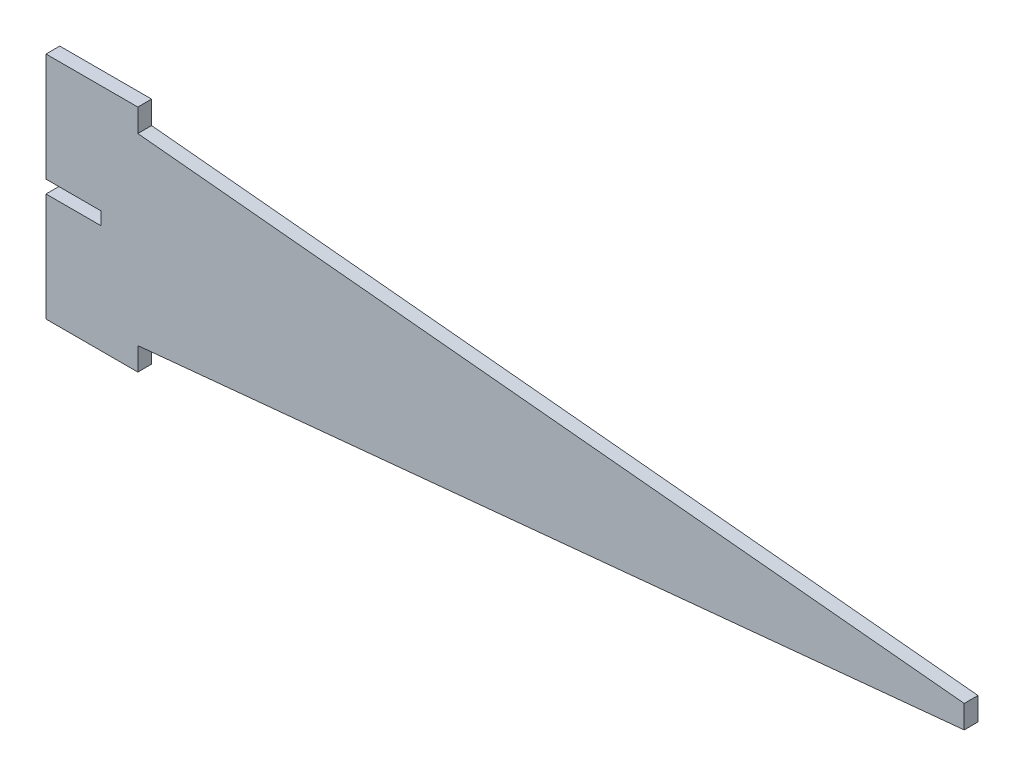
ISO-10303-21;
HEADER;
FILE_DESCRIPTION(('STEP AP214'),'2;1');
FILE_NAME('part.step','',(''),(''),'','','');
FILE_SCHEMA(('AUTOMOTIVE_DESIGN { 1 0 10303 214 1 1 1 1 }'));
ENDSEC;
DATA;
#1=APPLICATION_CONTEXT('core data for automotive mechanical design processes');
#2=APPLICATION_PROTOCOL_DEFINITION('international standard','automotive_design',2000,#1);
#3=PRODUCT_CONTEXT('',#1,'mechanical');
#4=PRODUCT('Part','Part','',(#3));
#5=PRODUCT_RELATED_PRODUCT_CATEGORY('part','',(#4));
#6=PRODUCT_DEFINITION_FORMATION('','',#4);
#7=PRODUCT_DEFINITION_CONTEXT('part definition',#1,'design');
#8=PRODUCT_DEFINITION('design','',#6,#7);
#9=PRODUCT_DEFINITION_SHAPE('','',#8);
#10=(LENGTH_UNIT() NAMED_UNIT(*) SI_UNIT(.MILLI.,.METRE.));
#11=(NAMED_UNIT(*) PLANE_ANGLE_UNIT() SI_UNIT($,.RADIAN.));
#12=(NAMED_UNIT(*) SI_UNIT($,.STERADIAN.) SOLID_ANGLE_UNIT());
#13=UNCERTAINTY_MEASURE_WITH_UNIT(LENGTH_MEASURE(1.E-05),#10,'distance_accuracy_value','');
#14=(GEOMETRIC_REPRESENTATION_CONTEXT(3) GLOBAL_UNCERTAINTY_ASSIGNED_CONTEXT((#13)) GLOBAL_UNIT_ASSIGNED_CONTEXT((#10,
#11,#12)) REPRESENTATION_CONTEXT('',''));
#15=CARTESIAN_POINT('',(0.,0.,0.));
#16=DIRECTION('',(0.,0.,1.));
#17=DIRECTION('',(1.,0.,0.));
#18=AXIS2_PLACEMENT_3D('',#15,#16,#17);
#19=CARTESIAN_POINT('',(-12.,1.4,3.));
#20=DIRECTION('',(1.,0.,0.));
#21=DIRECTION('',(0.,0.,-1.));
#22=AXIS2_PLACEMENT_3D('',#19,#20,#21);
#23=PLANE('',#22);
#24=DIRECTION('',(0.,-1.,0.));
#25=VECTOR('',#24,1.);
#26=CARTESIAN_POINT('',(-12.,1.4,0.));
#27=LINE('',#26,#25);
#28=CARTESIAN_POINT('',(-12.,25.,0.));
#29=VERTEX_POINT('',#28);
#30=CARTESIAN_POINT('',(-12.,1.4,0.));
#31=VERTEX_POINT('',#30);
#32=EDGE_CURVE('E157',#29,#31,#27,.T.);
#33=ORIENTED_EDGE('',*,*,#32,.T.);
#34=DIRECTION('',(0.,0.,-1.));
#35=VECTOR('',#34,1.);
#36=CARTESIAN_POINT('',(-12.,1.4,3.));
#37=LINE('',#36,#35);
#38=CARTESIAN_POINT('',(-12.,1.4,3.));
#39=VERTEX_POINT('',#38);
#40=EDGE_CURVE('E11',#39,#31,#37,.T.);
#41=ORIENTED_EDGE('',*,*,#40,.F.);
#42=DIRECTION('',(0.,-1.,0.));
#43=VECTOR('',#42,1.);
#44=CARTESIAN_POINT('',(-12.,1.4,3.));
#45=LINE('',#44,#43);
#46=CARTESIAN_POINT('',(-12.,25.,3.));
#47=VERTEX_POINT('',#46);
#48=EDGE_CURVE('E182',#47,#39,#45,.T.);
#49=ORIENTED_EDGE('',*,*,#48,.F.);
#50=DIRECTION('',(0.,0.,-1.));
#51=VECTOR('',#50,1.);
#52=CARTESIAN_POINT('',(-12.,25.,3.));
#53=LINE('',#52,#51);
#54=EDGE_CURVE('E154',#47,#29,#53,.T.);
#55=ORIENTED_EDGE('',*,*,#54,.T.);
#56=EDGE_LOOP('',(#33,#41,#49,#55));
#57=FACE_BOUND('',#56,.T.);
#58=ADVANCED_FACE('F39',(#57),#23,.F.);
#59=CARTESIAN_POINT('',(-12.,1.4,3.));
#60=DIRECTION('',(0.,1.,0.));
#61=DIRECTION('',(0.,0.,1.));
#62=AXIS2_PLACEMENT_3D('',#59,#60,#61);
#63=PLANE('',#62);
#64=DIRECTION('',(1.,0.,0.));
#65=VECTOR('',#64,1.);
#66=CARTESIAN_POINT('',(-12.,1.4,0.));
#67=LINE('',#66,#65);
#68=CARTESIAN_POINT('',(0.,1.4,0.));
#69=VERTEX_POINT('',#68);
#70=EDGE_CURVE('E165',#31,#69,#67,.T.);
#71=ORIENTED_EDGE('',*,*,#70,.T.);
#72=DIRECTION('',(0.,0.,-1.));
#73=VECTOR('',#72,1.);
#74=CARTESIAN_POINT('',(0.,1.4,3.));
#75=LINE('',#74,#73);
#76=CARTESIAN_POINT('',(0.,1.4,3.));
#77=VERTEX_POINT('',#76);
#78=EDGE_CURVE('E50',#77,#69,#75,.T.);
#79=ORIENTED_EDGE('',*,*,#78,.F.);
#80=DIRECTION('',(1.,0.,0.));
#81=VECTOR('',#80,1.);
#82=CARTESIAN_POINT('',(-12.,1.4,3.));
#83=LINE('',#82,#81);
#84=EDGE_CURVE('E109',#39,#77,#83,.T.);
#85=ORIENTED_EDGE('',*,*,#84,.F.);
#86=ORIENTED_EDGE('',*,*,#40,.T.);
#87=EDGE_LOOP('',(#71,#79,#85,#86));
#88=FACE_BOUND('',#87,.T.);
#89=ADVANCED_FACE('F259',(#88),#63,.F.);
#90=CARTESIAN_POINT('',(0.,-1.4,3.));
#91=DIRECTION('',(1.,0.,0.));
#92=DIRECTION('',(0.,0.,-1.));
#93=AXIS2_PLACEMENT_3D('',#90,#91,#92);
#94=PLANE('',#93);
#95=DIRECTION('',(0.,-1.,0.));
#96=VECTOR('',#95,1.);
#97=CARTESIAN_POINT('',(0.,-1.4,0.));
#98=LINE('',#97,#96);
#99=CARTESIAN_POINT('',(0.,-1.4,0.));
#100=VERTEX_POINT('',#99);
#101=EDGE_CURVE('E163',#69,#100,#98,.T.);
#102=ORIENTED_EDGE('',*,*,#101,.T.);
#103=DIRECTION('',(0.,0.,-1.));
#104=VECTOR('',#103,1.);
#105=CARTESIAN_POINT('',(0.,-1.4,3.));
#106=LINE('',#105,#104);
#107=CARTESIAN_POINT('',(0.,-1.4,3.));
#108=VERTEX_POINT('',#107);
#109=EDGE_CURVE('E199',#108,#100,#106,.T.);
#110=ORIENTED_EDGE('',*,*,#109,.F.);
#111=DIRECTION('',(0.,-1.,0.));
#112=VECTOR('',#111,1.);
#113=CARTESIAN_POINT('',(0.,-1.4,3.));
#114=LINE('',#113,#112);
#115=EDGE_CURVE('E208',#77,#108,#114,.T.);
#116=ORIENTED_EDGE('',*,*,#115,.F.);
#117=ORIENTED_EDGE('',*,*,#78,.T.);
#118=EDGE_LOOP('',(#102,#110,#116,#117));
#119=FACE_BOUND('',#118,.T.);
#120=ADVANCED_FACE('F206',(#119),#94,.F.);
#121=CARTESIAN_POINT('',(-12.,-1.4,3.));
#122=DIRECTION('',(0.,-1.,0.));
#123=DIRECTION('',(0.,0.,-1.));
#124=AXIS2_PLACEMENT_3D('',#121,#122,#123);
#125=PLANE('',#124);
#126=DIRECTION('',(-1.,0.,0.));
#127=VECTOR('',#126,1.);
#128=CARTESIAN_POINT('',(-12.,-1.4,0.));
#129=LINE('',#128,#127);
#130=CARTESIAN_POINT('',(-12.,-1.4,0.));
#131=VERTEX_POINT('',#130);
#132=EDGE_CURVE('E167',#100,#131,#129,.T.);
#133=ORIENTED_EDGE('',*,*,#132,.T.);
#134=DIRECTION('',(0.,0.,-1.));
#135=VECTOR('',#134,1.);
#136=CARTESIAN_POINT('',(-12.,-1.4,3.));
#137=LINE('',#136,#135);
#138=CARTESIAN_POINT('',(-12.,-1.4,3.));
#139=VERTEX_POINT('',#138);
#140=EDGE_CURVE('E197',#139,#131,#137,.T.);
#141=ORIENTED_EDGE('',*,*,#140,.F.);
#142=DIRECTION('',(-1.,0.,0.));
#143=VECTOR('',#142,1.);
#144=CARTESIAN_POINT('',(-12.,-1.4,3.));
#145=LINE('',#144,#143);
#146=EDGE_CURVE('E227',#108,#139,#145,.T.);
#147=ORIENTED_EDGE('',*,*,#146,.F.);
#148=ORIENTED_EDGE('',*,*,#109,.T.);
#149=EDGE_LOOP('',(#133,#141,#147,#148));
#150=FACE_BOUND('',#149,.T.);
#151=ADVANCED_FACE('F220',(#150),#125,.F.);
#152=CARTESIAN_POINT('',(-12.,-25.,3.));
#153=DIRECTION('',(1.,0.,0.));
#154=DIRECTION('',(0.,0.,-1.));
#155=AXIS2_PLACEMENT_3D('',#152,#153,#154);
#156=PLANE('',#155);
#157=DIRECTION('',(0.,-1.,0.));
#158=VECTOR('',#157,1.);
#159=CARTESIAN_POINT('',(-12.,-25.,0.));
#160=LINE('',#159,#158);
#161=CARTESIAN_POINT('',(-12.,-25.,0.));
#162=VERTEX_POINT('',#161);
#163=EDGE_CURVE('E169',#131,#162,#160,.T.);
#164=ORIENTED_EDGE('',*,*,#163,.T.);
#165=DIRECTION('',(0.,0.,-1.));
#166=VECTOR('',#165,1.);
#167=CARTESIAN_POINT('',(-12.,-25.,3.));
#168=LINE('',#167,#166);
#169=CARTESIAN_POINT('',(-12.,-25.,3.));
#170=VERTEX_POINT('',#169);
#171=EDGE_CURVE('E195',#170,#162,#168,.T.);
#172=ORIENTED_EDGE('',*,*,#171,.F.);
#173=DIRECTION('',(0.,-1.,0.));
#174=VECTOR('',#173,1.);
#175=CARTESIAN_POINT('',(-12.,-25.,3.));
#176=LINE('',#175,#174);
#177=EDGE_CURVE('E224',#139,#170,#176,.T.);
#178=ORIENTED_EDGE('',*,*,#177,.F.);
#179=ORIENTED_EDGE('',*,*,#140,.T.);
#180=EDGE_LOOP('',(#164,#172,#178,#179));
#181=FACE_BOUND('',#180,.T.);
#182=ADVANCED_FACE('F222',(#181),#156,.F.);
#183=CARTESIAN_POINT('',(-12.,-25.,3.));
#184=DIRECTION('',(0.,1.,0.));
#185=DIRECTION('',(0.,0.,1.));
#186=AXIS2_PLACEMENT_3D('',#183,#184,#185);
#187=PLANE('',#186);
#188=DIRECTION('',(1.,0.,0.));
#189=VECTOR('',#188,1.);
#190=CARTESIAN_POINT('',(-12.,-25.,0.));
#191=LINE('',#190,#189);
#192=CARTESIAN_POINT('',(8.,-25.,0.));
#193=VERTEX_POINT('',#192);
#194=EDGE_CURVE('E168',#162,#193,#191,.T.);
#195=ORIENTED_EDGE('',*,*,#194,.T.);
#196=DIRECTION('',(0.,0.,-1.));
#197=VECTOR('',#196,1.);
#198=CARTESIAN_POINT('',(8.,-25.,3.));
#199=LINE('',#198,#197);
#200=CARTESIAN_POINT('',(8.,-25.,3.));
#201=VERTEX_POINT('',#200);
#202=EDGE_CURVE('E193',#201,#193,#199,.T.);
#203=ORIENTED_EDGE('',*,*,#202,.F.);
#204=DIRECTION('',(1.,0.,0.));
#205=VECTOR('',#204,1.);
#206=CARTESIAN_POINT('',(-12.,-25.,3.));
#207=LINE('',#206,#205);
#208=EDGE_CURVE('E223',#170,#201,#207,.T.);
#209=ORIENTED_EDGE('',*,*,#208,.F.);
#210=ORIENTED_EDGE('',*,*,#171,.T.);
#211=EDGE_LOOP('',(#195,#203,#209,#210));
#212=FACE_BOUND('',#211,.T.);
#213=ADVANCED_FACE('F275',(#212),#187,.F.);
#214=CARTESIAN_POINT('',(8.,-25.,3.));
#215=DIRECTION('',(-1.,0.,0.));
#216=DIRECTION('',(0.,-1.,0.));
#217=AXIS2_PLACEMENT_3D('',#214,#215,#216);
#218=PLANE('',#217);
#219=DIRECTION('',(0.,1.,0.));
#220=VECTOR('',#219,1.);
#221=CARTESIAN_POINT('',(8.,-25.,0.));
#222=LINE('',#221,#220);
#223=CARTESIAN_POINT('',(7.99999999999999,-20.,0.));
#224=VERTEX_POINT('',#223);
#225=EDGE_CURVE('E175',#193,#224,#222,.T.);
#226=ORIENTED_EDGE('',*,*,#225,.T.);
#227=DIRECTION('',(0.,0.,-1.));
#228=VECTOR('',#227,1.);
#229=CARTESIAN_POINT('',(7.99999999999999,-20.,3.));
#230=LINE('',#229,#228);
#231=CARTESIAN_POINT('',(7.99999999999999,-20.,3.));
#232=VERTEX_POINT('',#231);
#233=EDGE_CURVE('E189',#232,#224,#230,.T.);
#234=ORIENTED_EDGE('',*,*,#233,.F.);
#235=DIRECTION('',(0.,1.,0.));
#236=VECTOR('',#235,1.);
#237=CARTESIAN_POINT('',(8.,-25.,3.));
#238=LINE('',#237,#236);
#239=EDGE_CURVE('E229',#201,#232,#238,.T.);
#240=ORIENTED_EDGE('',*,*,#239,.F.);
#241=ORIENTED_EDGE('',*,*,#202,.T.);
#242=EDGE_LOOP('',(#226,#234,#240,#241));
#243=FACE_BOUND('',#242,.T.);
#244=ADVANCED_FACE('F274',(#243),#218,.F.);
#245=CARTESIAN_POINT('',(7.99999999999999,-20.,3.));
#246=DIRECTION('',(-0.0967659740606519,0.995307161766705,0.));
#247=DIRECTION('',(-0.995307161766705,-0.0967659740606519,0.));
#248=AXIS2_PLACEMENT_3D('',#245,#246,#247);
#249=PLANE('',#248);
#250=DIRECTION('',(0.995307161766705,0.0967659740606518,0.));
#251=VECTOR('',#250,1.);
#252=CARTESIAN_POINT('',(7.99999999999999,-20.,0.));
#253=LINE('',#252,#251);
#254=CARTESIAN_POINT('',(188.,-2.5,0.));
#255=VERTEX_POINT('',#254);
#256=EDGE_CURVE('E171',#224,#255,#253,.T.);
#257=ORIENTED_EDGE('',*,*,#256,.T.);
#258=DIRECTION('',(0.,0.,-1.));
#259=VECTOR('',#258,1.);
#260=CARTESIAN_POINT('',(188.,-2.5,3.));
#261=LINE('',#260,#259);
#262=CARTESIAN_POINT('',(188.,-2.5,3.));
#263=VERTEX_POINT('',#262);
#264=EDGE_CURVE('E183',#263,#255,#261,.T.);
#265=ORIENTED_EDGE('',*,*,#264,.F.);
#266=DIRECTION('',(0.995307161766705,0.0967659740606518,0.));
#267=VECTOR('',#266,1.);
#268=CARTESIAN_POINT('',(7.99999999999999,-20.,3.));
#269=LINE('',#268,#267);
#270=EDGE_CURVE('E235',#232,#263,#269,.T.);
#271=ORIENTED_EDGE('',*,*,#270,.F.);
#272=ORIENTED_EDGE('',*,*,#233,.T.);
#273=EDGE_LOOP('',(#257,#265,#271,#272));
#274=FACE_BOUND('',#273,.T.);
#275=ADVANCED_FACE('F238',(#274),#249,.F.);
#276=CARTESIAN_POINT('',(188.,2.5,3.));
#277=DIRECTION('',(-1.,0.,0.));
#278=DIRECTION('',(0.,0.,1.));
#279=AXIS2_PLACEMENT_3D('',#276,#277,#278);
#280=PLANE('',#279);
#281=DIRECTION('',(0.,1.,0.));
#282=VECTOR('',#281,1.);
#283=CARTESIAN_POINT('',(188.,2.5,0.));
#284=LINE('',#283,#282);
#285=CARTESIAN_POINT('',(188.,2.5,0.));
#286=VERTEX_POINT('',#285);
#287=EDGE_CURVE('E178',#255,#286,#284,.T.);
#288=ORIENTED_EDGE('',*,*,#287,.T.);
#289=DIRECTION('',(0.,0.,-1.));
#290=VECTOR('',#289,1.);
#291=CARTESIAN_POINT('',(188.,2.5,3.));
#292=LINE('',#291,#290);
#293=CARTESIAN_POINT('',(188.,2.5,3.));
#294=VERTEX_POINT('',#293);
#295=EDGE_CURVE('E147',#294,#286,#292,.T.);
#296=ORIENTED_EDGE('',*,*,#295,.F.);
#297=DIRECTION('',(0.,1.,0.));
#298=VECTOR('',#297,1.);
#299=CARTESIAN_POINT('',(188.,2.5,3.));
#300=LINE('',#299,#298);
#301=EDGE_CURVE('E143',#263,#294,#300,.T.);
#302=ORIENTED_EDGE('',*,*,#301,.F.);
#303=ORIENTED_EDGE('',*,*,#264,.T.);
#304=EDGE_LOOP('',(#288,#296,#302,#303));
#305=FACE_BOUND('',#304,.T.);
#306=ADVANCED_FACE('F241',(#305),#280,.F.);
#307=CARTESIAN_POINT('',(7.99999999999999,20.,3.));
#308=DIRECTION('',(-0.0967659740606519,-0.995307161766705,0.));
#309=DIRECTION('',(0.995307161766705,-0.0967659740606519,0.));
#310=AXIS2_PLACEMENT_3D('',#307,#308,#309);
#311=PLANE('',#310);
#312=DIRECTION('',(-0.995307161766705,0.0967659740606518,0.));
#313=VECTOR('',#312,1.);
#314=CARTESIAN_POINT('',(7.99999999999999,20.,0.));
#315=LINE('',#314,#313);
#316=CARTESIAN_POINT('',(7.99999999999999,20.,0.));
#317=VERTEX_POINT('',#316);
#318=EDGE_CURVE('E149',#286,#317,#315,.T.);
#319=ORIENTED_EDGE('',*,*,#318,.T.);
#320=DIRECTION('',(0.,0.,-1.));
#321=VECTOR('',#320,1.);
#322=CARTESIAN_POINT('',(7.99999999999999,20.,3.));
#323=LINE('',#322,#321);
#324=CARTESIAN_POINT('',(7.99999999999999,20.,3.));
#325=VERTEX_POINT('',#324);
#326=EDGE_CURVE('E148',#325,#317,#323,.T.);
#327=ORIENTED_EDGE('',*,*,#326,.F.);
#328=DIRECTION('',(-0.995307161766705,0.0967659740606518,0.));
#329=VECTOR('',#328,1.);
#330=CARTESIAN_POINT('',(7.99999999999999,20.,3.));
#331=LINE('',#330,#329);
#332=EDGE_CURVE('E133',#294,#325,#331,.T.);
#333=ORIENTED_EDGE('',*,*,#332,.F.);
#334=ORIENTED_EDGE('',*,*,#295,.T.);
#335=EDGE_LOOP('',(#319,#327,#333,#334));
#336=FACE_BOUND('',#335,.T.);
#337=ADVANCED_FACE('F150',(#336),#311,.F.);
#338=CARTESIAN_POINT('',(8.,25.,3.));
#339=DIRECTION('',(-1.,0.,0.));
#340=DIRECTION('',(0.,-1.,0.));
#341=AXIS2_PLACEMENT_3D('',#338,#339,#340);
#342=PLANE('',#341);
#343=DIRECTION('',(0.,1.,0.));
#344=VECTOR('',#343,1.);
#345=CARTESIAN_POINT('',(8.,25.,0.));
#346=LINE('',#345,#344);
#347=CARTESIAN_POINT('',(8.,25.,0.));
#348=VERTEX_POINT('',#347);
#349=EDGE_CURVE('E96',#317,#348,#346,.T.);
#350=ORIENTED_EDGE('',*,*,#349,.T.);
#351=DIRECTION('',(0.,0.,-1.));
#352=VECTOR('',#351,1.);
#353=CARTESIAN_POINT('',(8.,25.,3.));
#354=LINE('',#353,#352);
#355=CARTESIAN_POINT('',(8.,25.,3.));
#356=VERTEX_POINT('',#355);
#357=EDGE_CURVE('E151',#356,#348,#354,.T.);
#358=ORIENTED_EDGE('',*,*,#357,.F.);
#359=DIRECTION('',(0.,1.,0.));
#360=VECTOR('',#359,1.);
#361=CARTESIAN_POINT('',(8.,25.,3.));
#362=LINE('',#361,#360);
#363=EDGE_CURVE('E140',#325,#356,#362,.T.);
#364=ORIENTED_EDGE('',*,*,#363,.F.);
#365=ORIENTED_EDGE('',*,*,#326,.T.);
#366=EDGE_LOOP('',(#350,#358,#364,#365));
#367=FACE_BOUND('',#366,.T.);
#368=ADVANCED_FACE('F153',(#367),#342,.F.);
#369=CARTESIAN_POINT('',(-12.,25.,3.));
#370=DIRECTION('',(0.,-1.,0.));
#371=DIRECTION('',(0.,0.,-1.));
#372=AXIS2_PLACEMENT_3D('',#369,#370,#371);
#373=PLANE('',#372);
#374=DIRECTION('',(-1.,0.,0.));
#375=VECTOR('',#374,1.);
#376=CARTESIAN_POINT('',(-12.,25.,0.));
#377=LINE('',#376,#375);
#378=EDGE_CURVE('E105',#348,#29,#377,.T.);
#379=ORIENTED_EDGE('',*,*,#378,.T.);
#380=ORIENTED_EDGE('',*,*,#54,.F.);
#381=DIRECTION('',(-1.,0.,0.));
#382=VECTOR('',#381,1.);
#383=CARTESIAN_POINT('',(-12.,25.,3.));
#384=LINE('',#383,#382);
#385=EDGE_CURVE('E54',#356,#47,#384,.T.);
#386=ORIENTED_EDGE('',*,*,#385,.F.);
#387=ORIENTED_EDGE('',*,*,#357,.T.);
#388=EDGE_LOOP('',(#379,#380,#386,#387));
#389=FACE_BOUND('',#388,.T.);
#390=ADVANCED_FACE('F247',(#389),#373,.F.);
#391=CARTESIAN_POINT('',(0.,0.,3.));
#392=DIRECTION('',(0.,0.,-1.));
#393=DIRECTION('',(-1.,0.,0.));
#394=AXIS2_PLACEMENT_3D('',#391,#392,#393);
#395=PLANE('',#394);
#396=ORIENTED_EDGE('',*,*,#48,.T.);
#397=ORIENTED_EDGE('',*,*,#84,.T.);
#398=ORIENTED_EDGE('',*,*,#115,.T.);
#399=ORIENTED_EDGE('',*,*,#146,.T.);
#400=ORIENTED_EDGE('',*,*,#177,.T.);
#401=ORIENTED_EDGE('',*,*,#208,.T.);
#402=ORIENTED_EDGE('',*,*,#239,.T.);
#403=ORIENTED_EDGE('',*,*,#270,.T.);
#404=ORIENTED_EDGE('',*,*,#301,.T.);
#405=ORIENTED_EDGE('',*,*,#332,.T.);
#406=ORIENTED_EDGE('',*,*,#363,.T.);
#407=ORIENTED_EDGE('',*,*,#385,.T.);
#408=EDGE_LOOP('',(#396,#397,#398,#399,#400,#401,#402,#403,#404,#405,#406,#407));
#409=FACE_BOUND('',#408,.T.);
#410=ADVANCED_FACE('F139',(#409),#395,.F.);
#411=CARTESIAN_POINT('',(0.,0.,0.));
#412=DIRECTION('',(0.,0.,-1.));
#413=DIRECTION('',(-1.,0.,0.));
#414=AXIS2_PLACEMENT_3D('',#411,#412,#413);
#415=PLANE('',#414);
#416=ORIENTED_EDGE('',*,*,#32,.F.);
#417=ORIENTED_EDGE('',*,*,#378,.F.);
#418=ORIENTED_EDGE('',*,*,#349,.F.);
#419=ORIENTED_EDGE('',*,*,#318,.F.);
#420=ORIENTED_EDGE('',*,*,#287,.F.);
#421=ORIENTED_EDGE('',*,*,#256,.F.);
#422=ORIENTED_EDGE('',*,*,#225,.F.);
#423=ORIENTED_EDGE('',*,*,#194,.F.);
#424=ORIENTED_EDGE('',*,*,#163,.F.);
#425=ORIENTED_EDGE('',*,*,#132,.F.);
#426=ORIENTED_EDGE('',*,*,#101,.F.);
#427=ORIENTED_EDGE('',*,*,#70,.F.);
#428=EDGE_LOOP('',(#416,#417,#418,#419,#420,#421,#422,#423,#424,#425,#426,#427));
#429=FACE_BOUND('',#428,.T.);
#430=ADVANCED_FACE('F215',(#429),#415,.T.);
#431=CLOSED_SHELL('',(#58,#89,#120,#151,#182,#213,#244,#275,#306,#337,#368,#390,#410,#430));
#432=MANIFOLD_SOLID_BREP('B2',#431);
#433=ADVANCED_BREP_SHAPE_REPRESENTATION('',(#18,#432),#14);
#434=SHAPE_DEFINITION_REPRESENTATION(#9,#433);
ENDSEC;
END-ISO-10303-21;
